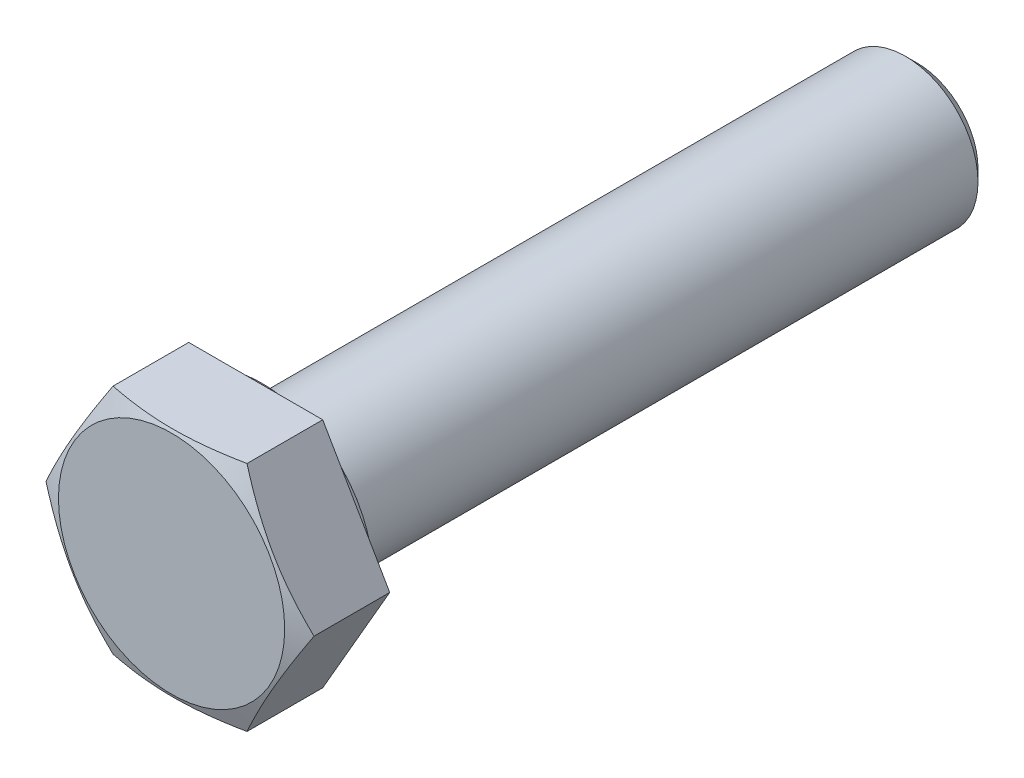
ISO-10303-21;
HEADER;
FILE_DESCRIPTION(('STEP AP214'),'2;1');
FILE_NAME('part.step','',(''),(''),'','','');
FILE_SCHEMA(('AUTOMOTIVE_DESIGN { 1 0 10303 214 1 1 1 1 }'));
ENDSEC;
DATA;
#1=APPLICATION_CONTEXT('core data for automotive mechanical design processes');
#2=APPLICATION_PROTOCOL_DEFINITION('international standard','automotive_design',2000,#1);
#3=PRODUCT_CONTEXT('',#1,'mechanical');
#4=PRODUCT('Part','Part','',(#3));
#5=PRODUCT_RELATED_PRODUCT_CATEGORY('part','',(#4));
#6=PRODUCT_DEFINITION_FORMATION('','',#4);
#7=PRODUCT_DEFINITION_CONTEXT('part definition',#1,'design');
#8=PRODUCT_DEFINITION('design','',#6,#7);
#9=PRODUCT_DEFINITION_SHAPE('','',#8);
#10=(LENGTH_UNIT() NAMED_UNIT(*) SI_UNIT(.MILLI.,.METRE.));
#11=(NAMED_UNIT(*) PLANE_ANGLE_UNIT() SI_UNIT($,.RADIAN.));
#12=(NAMED_UNIT(*) SI_UNIT($,.STERADIAN.) SOLID_ANGLE_UNIT());
#13=UNCERTAINTY_MEASURE_WITH_UNIT(LENGTH_MEASURE(1.E-05),#10,'distance_accuracy_value','');
#14=(GEOMETRIC_REPRESENTATION_CONTEXT(3) GLOBAL_UNCERTAINTY_ASSIGNED_CONTEXT((#13)) GLOBAL_UNIT_ASSIGNED_CONTEXT((#10,
#11,#12)) REPRESENTATION_CONTEXT('',''));
#15=CARTESIAN_POINT('',(0.,0.,0.));
#16=DIRECTION('',(0.,0.,1.));
#17=DIRECTION('',(1.,0.,0.));
#18=AXIS2_PLACEMENT_3D('',#15,#16,#17);
#19=CARTESIAN_POINT('',(0.,7.835,0.6));
#20=DIRECTION('',(0.,0.,1.));
#21=DIRECTION('',(1.,0.,0.));
#22=AXIS2_PLACEMENT_3D('',#19,#20,#21);
#23=PLANE('',#22);
#24=CARTESIAN_POINT('',(0.,0.,0.6));
#25=DIRECTION('',(0.,0.,1.));
#26=DIRECTION('',(1.,0.,0.));
#27=AXIS2_PLACEMENT_3D('',#24,#25,#26);
#28=CIRCLE('',#27,7.835);
#29=CARTESIAN_POINT('',(7.835,0.,0.6));
#30=VERTEX_POINT('',#29);
#31=EDGE_CURVE('E228',#30,#30,#28,.T.);
#32=ORIENTED_EDGE('',*,*,#31,.T.);
#33=EDGE_LOOP('',(#32));
#34=FACE_BOUND('',#33,.T.);
#35=DIRECTION('',(-1.,0.,0.));
#36=VECTOR('',#35,1.);
#37=CARTESIAN_POINT('',(0.,-7.99999626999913,0.6));
#38=LINE('',#37,#36);
#39=CARTESIAN_POINT('',(4.6188,-7.99999626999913,0.6));
#40=VERTEX_POINT('',#39);
#41=CARTESIAN_POINT('',(-4.6188,-7.99999626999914,0.6));
#42=VERTEX_POINT('',#41);
#43=EDGE_CURVE('E214',#40,#42,#38,.T.);
#44=ORIENTED_EDGE('',*,*,#43,.T.);
#45=DIRECTION('',(-0.5,0.866025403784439,0.));
#46=VECTOR('',#45,1.);
#47=CARTESIAN_POINT('',(-10.3208545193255,1.87625186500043,0.6));
#48=LINE('',#47,#46);
#49=CARTESIAN_POINT('',(-9.2376,0.,0.6));
#50=VERTEX_POINT('',#49);
#51=EDGE_CURVE('E83',#42,#50,#48,.T.);
#52=ORIENTED_EDGE('',*,*,#51,.T.);
#53=DIRECTION('',(0.5,0.866025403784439,0.));
#54=VECTOR('',#53,1.);
#55=CARTESIAN_POINT('',(-3.53554548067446,9.87624813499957,0.6));
#56=LINE('',#55,#54);
#57=CARTESIAN_POINT('',(-4.6188,7.99999626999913,0.6));
#58=VERTEX_POINT('',#57);
#59=EDGE_CURVE('E222',#50,#58,#56,.T.);
#60=ORIENTED_EDGE('',*,*,#59,.T.);
#61=DIRECTION('',(1.,0.,0.));
#62=VECTOR('',#61,1.);
#63=CARTESIAN_POINT('',(0.,7.99999626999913,0.6));
#64=LINE('',#63,#62);
#65=CARTESIAN_POINT('',(4.6188,7.99999626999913,0.6));
#66=VERTEX_POINT('',#65);
#67=EDGE_CURVE('E219',#58,#66,#64,.T.);
#68=ORIENTED_EDGE('',*,*,#67,.T.);
#69=DIRECTION('',(0.5,-0.866025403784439,0.));
#70=VECTOR('',#69,1.);
#71=CARTESIAN_POINT('',(3.53554548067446,9.87624813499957,0.6));
#72=LINE('',#71,#70);
#73=CARTESIAN_POINT('',(9.2376,0.,0.6));
#74=VERTEX_POINT('',#73);
#75=EDGE_CURVE('E217',#66,#74,#72,.T.);
#76=ORIENTED_EDGE('',*,*,#75,.T.);
#77=DIRECTION('',(-0.5,-0.866025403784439,0.));
#78=VECTOR('',#77,1.);
#79=CARTESIAN_POINT('',(10.3208545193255,1.87625186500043,0.6));
#80=LINE('',#79,#78);
#81=EDGE_CURVE('E202',#74,#40,#80,.T.);
#82=ORIENTED_EDGE('',*,*,#81,.T.);
#83=EDGE_LOOP('',(#44,#52,#60,#68,#76,#82));
#84=FACE_BOUND('',#83,.T.);
#85=ADVANCED_FACE('F16',(#34,#84),#23,.F.);
#86=CARTESIAN_POINT('',(0.,0.,-45.));
#87=DIRECTION('',(0.,0.,1.));
#88=DIRECTION('',(1.,0.,0.));
#89=AXIS2_PLACEMENT_3D('',#86,#87,#88);
#90=PLANE('',#89);
#91=CARTESIAN_POINT('',(0.,0.,-45.));
#92=DIRECTION('',(0.,0.,1.));
#93=DIRECTION('',(1.,0.,0.));
#94=AXIS2_PLACEMENT_3D('',#91,#92,#93);
#95=CIRCLE('',#94,4.188125);
#96=CARTESIAN_POINT('',(4.188125,0.,-45.));
#97=VERTEX_POINT('',#96);
#98=EDGE_CURVE('E76',#97,#97,#95,.T.);
#99=ORIENTED_EDGE('',*,*,#98,.F.);
#100=EDGE_LOOP('',(#99));
#101=FACE_BOUND('',#100,.T.);
#102=ADVANCED_FACE('F18',(#101),#90,.F.);
#103=CARTESIAN_POINT('',(0.,0.,-45.));
#104=DIRECTION('',(0.,0.,1.));
#105=DIRECTION('',(1.,0.,0.));
#106=AXIS2_PLACEMENT_3D('',#103,#104,#105);
#107=CONICAL_SURFACE('',#106,4.188125,0.785398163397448);
#108=CARTESIAN_POINT('',(0.,0.,-44.188125));
#109=DIRECTION('',(0.,0.,1.));
#110=DIRECTION('',(1.,0.,0.));
#111=AXIS2_PLACEMENT_3D('',#108,#109,#110);
#112=CIRCLE('',#111,5.);
#113=CARTESIAN_POINT('',(5.,0.,-44.188125));
#114=VERTEX_POINT('',#113);
#115=EDGE_CURVE('E172',#114,#114,#112,.T.);
#116=ORIENTED_EDGE('',*,*,#115,.F.);
#117=EDGE_LOOP('',(#116));
#118=FACE_BOUND('',#117,.T.);
#119=ORIENTED_EDGE('',*,*,#98,.T.);
#120=EDGE_LOOP('',(#119));
#121=FACE_BOUND('',#120,.T.);
#122=ADVANCED_FACE('F134',(#118,#121),#107,.T.);
#123=CARTESIAN_POINT('',(0.,0.,6.4));
#124=DIRECTION('',(0.,0.,1.));
#125=DIRECTION('',(1.,0.,0.));
#126=AXIS2_PLACEMENT_3D('',#123,#124,#125);
#127=CYLINDRICAL_SURFACE('',#126,5.);
#128=CARTESIAN_POINT('',(0.,0.,-1.5));
#129=DIRECTION('',(0.,0.,1.));
#130=DIRECTION('',(1.,0.,0.));
#131=AXIS2_PLACEMENT_3D('',#128,#129,#130);
#132=CIRCLE('',#131,5.);
#133=CARTESIAN_POINT('',(5.,0.,-1.5));
#134=VERTEX_POINT('',#133);
#135=EDGE_CURVE('E176',#134,#134,#132,.T.);
#136=ORIENTED_EDGE('',*,*,#135,.F.);
#137=EDGE_LOOP('',(#136));
#138=FACE_BOUND('',#137,.T.);
#139=ORIENTED_EDGE('',*,*,#115,.T.);
#140=EDGE_LOOP('',(#139));
#141=FACE_BOUND('',#140,.T.);
#142=ADVANCED_FACE('F161',(#138,#141),#127,.T.);
#143=CARTESIAN_POINT('',(0.,5.,-1.5));
#144=DIRECTION('',(0.,0.,-1.));
#145=DIRECTION('',(-1.,0.,0.));
#146=AXIS2_PLACEMENT_3D('',#143,#144,#145);
#147=PLANE('',#146);
#148=CARTESIAN_POINT('',(0.,0.,-1.5));
#149=DIRECTION('',(0.,0.,1.));
#150=DIRECTION('',(1.,0.,0.));
#151=AXIS2_PLACEMENT_3D('',#148,#149,#150);
#152=CIRCLE('',#151,4.188125);
#153=CARTESIAN_POINT('',(4.188125,0.,-1.5));
#154=VERTEX_POINT('',#153);
#155=EDGE_CURVE('E242',#154,#154,#152,.T.);
#156=ORIENTED_EDGE('',*,*,#155,.F.);
#157=EDGE_LOOP('',(#156));
#158=FACE_BOUND('',#157,.T.);
#159=ORIENTED_EDGE('',*,*,#135,.T.);
#160=EDGE_LOOP('',(#159));
#161=FACE_BOUND('',#160,.T.);
#162=ADVANCED_FACE('F157',(#158,#161),#147,.F.);
#163=CARTESIAN_POINT('',(0.,0.,-1.5));
#164=DIRECTION('',(0.,0.,1.));
#165=DIRECTION('',(1.,0.,0.));
#166=AXIS2_PLACEMENT_3D('',#163,#164,#165);
#167=CONICAL_SURFACE('',#166,4.188125,1.0471975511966);
#168=CARTESIAN_POINT('',(0.,0.,-1.03126375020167));
#169=DIRECTION('',(0.,0.,1.));
#170=DIRECTION('',(1.,0.,0.));
#171=AXIS2_PLACEMENT_3D('',#168,#169,#170);
#172=CIRCLE('',#171,5.);
#173=CARTESIAN_POINT('',(5.,0.,-1.03126375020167));
#174=VERTEX_POINT('',#173);
#175=EDGE_CURVE('E239',#174,#174,#172,.T.);
#176=ORIENTED_EDGE('',*,*,#175,.F.);
#177=EDGE_LOOP('',(#176));
#178=FACE_BOUND('',#177,.T.);
#179=ORIENTED_EDGE('',*,*,#155,.T.);
#180=EDGE_LOOP('',(#179));
#181=FACE_BOUND('',#180,.T.);
#182=ADVANCED_FACE('F153',(#178,#181),#167,.T.);
#183=CARTESIAN_POINT('',(0.,0.,6.4));
#184=DIRECTION('',(0.,0.,1.));
#185=DIRECTION('',(1.,0.,0.));
#186=AXIS2_PLACEMENT_3D('',#183,#184,#185);
#187=CYLINDRICAL_SURFACE('',#186,5.);
#188=CARTESIAN_POINT('',(0.,0.,-0.5));
#189=DIRECTION('',(0.,0.,1.));
#190=DIRECTION('',(1.,0.,0.));
#191=AXIS2_PLACEMENT_3D('',#188,#189,#190);
#192=CIRCLE('',#191,5.);
#193=CARTESIAN_POINT('',(5.,0.,-0.5));
#194=VERTEX_POINT('',#193);
#195=EDGE_CURVE('E236',#194,#194,#192,.T.);
#196=ORIENTED_EDGE('',*,*,#195,.F.);
#197=EDGE_LOOP('',(#196));
#198=FACE_BOUND('',#197,.T.);
#199=ORIENTED_EDGE('',*,*,#175,.T.);
#200=EDGE_LOOP('',(#199));
#201=FACE_BOUND('',#200,.T.);
#202=ADVANCED_FACE('F149',(#198,#201),#187,.T.);
#203=CARTESIAN_POINT('',(0.,0.,-0.5));
#204=DIRECTION('',(0.,0.,1.));
#205=DIRECTION('',(1.,0.,0.));
#206=AXIS2_PLACEMENT_3D('',#203,#204,#205);
#207=TOROIDAL_SURFACE('',#206,5.5,0.5);
#208=ORIENTED_EDGE('',*,*,#195,.T.);
#209=EDGE_LOOP('',(#208));
#210=FACE_BOUND('',#209,.T.);
#211=CARTESIAN_POINT('',(0.,0.,0.));
#212=DIRECTION('',(0.,0.,1.));
#213=DIRECTION('',(1.,0.,0.));
#214=AXIS2_PLACEMENT_3D('',#211,#212,#213);
#215=CIRCLE('',#214,5.5);
#216=CARTESIAN_POINT('',(5.5,0.,0.));
#217=VERTEX_POINT('',#216);
#218=EDGE_CURVE('E233',#217,#217,#215,.T.);
#219=ORIENTED_EDGE('',*,*,#218,.F.);
#220=EDGE_LOOP('',(#219));
#221=FACE_BOUND('',#220,.T.);
#222=ADVANCED_FACE('F145',(#210,#221),#207,.F.);
#223=CARTESIAN_POINT('',(0.,5.5,0.));
#224=DIRECTION('',(0.,0.,1.));
#225=DIRECTION('',(1.,0.,0.));
#226=AXIS2_PLACEMENT_3D('',#223,#224,#225);
#227=PLANE('',#226);
#228=CARTESIAN_POINT('',(0.,0.,0.));
#229=DIRECTION('',(0.,0.,1.));
#230=DIRECTION('',(1.,0.,0.));
#231=AXIS2_PLACEMENT_3D('',#228,#229,#230);
#232=CIRCLE('',#231,7.235);
#233=CARTESIAN_POINT('',(7.235,0.,0.));
#234=VERTEX_POINT('',#233);
#235=EDGE_CURVE('E230',#234,#234,#232,.T.);
#236=ORIENTED_EDGE('',*,*,#235,.F.);
#237=EDGE_LOOP('',(#236));
#238=FACE_BOUND('',#237,.T.);
#239=ORIENTED_EDGE('',*,*,#218,.T.);
#240=EDGE_LOOP('',(#239));
#241=FACE_BOUND('',#240,.T.);
#242=ADVANCED_FACE('F141',(#238,#241),#227,.F.);
#243=CARTESIAN_POINT('',(0.,0.,0.6));
#244=DIRECTION('',(0.,0.,1.));
#245=DIRECTION('',(1.,0.,0.));
#246=AXIS2_PLACEMENT_3D('',#243,#244,#245);
#247=TOROIDAL_SURFACE('',#246,7.235,0.6);
#248=ORIENTED_EDGE('',*,*,#31,.F.);
#249=EDGE_LOOP('',(#248));
#250=FACE_BOUND('',#249,.T.);
#251=ORIENTED_EDGE('',*,*,#235,.T.);
#252=EDGE_LOOP('',(#251));
#253=FACE_BOUND('',#252,.T.);
#254=ADVANCED_FACE('F116',(#250,#253),#247,.T.);
#255=CARTESIAN_POINT('',(-4.6188,-7.99999626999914,-45.));
#256=DIRECTION('',(0.866025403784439,0.5,0.));
#257=DIRECTION('',(0.5,-0.866025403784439,0.));
#258=AXIS2_PLACEMENT_3D('',#255,#256,#257);
#259=PLANE('',#258);
#260=ORIENTED_EDGE('',*,*,#51,.F.);
#261=DIRECTION('',(0.,0.,1.));
#262=VECTOR('',#261,1.);
#263=CARTESIAN_POINT('',(-4.6188,-7.99999626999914,-45.));
#264=LINE('',#263,#262);
#265=CARTESIAN_POINT('',(-4.6188,-7.99999626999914,5.81818181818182));
#266=VERTEX_POINT('',#265);
#267=EDGE_CURVE('E36',#42,#266,#264,.T.);
#268=ORIENTED_EDGE('',*,*,#267,.T.);
#269=CARTESIAN_POINT('',(-9.23760011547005,2.E-07,5.81818177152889));
#270=CARTESIAN_POINT('',(-9.07623171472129,-0.27949806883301,5.88338258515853));
#271=CARTESIAN_POINT('',(-8.91433070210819,-0.559918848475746,5.94367122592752));
#272=CARTESIAN_POINT('',(-8.58945812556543,-1.12261465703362,6.05257118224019));
#273=CARTESIAN_POINT('',(-8.42648599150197,-1.40489067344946,6.10117565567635));
#274=CARTESIAN_POINT('',(-8.09970314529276,-1.97089516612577,6.184761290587));
#275=CARTESIAN_POINT('',(-7.93589269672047,-2.25462318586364,6.21974649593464));
#276=CARTESIAN_POINT('',(-7.60766331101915,-2.82313315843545,6.27447232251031));
#277=CARTESIAN_POINT('',(-7.44324451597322,-3.10791486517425,6.2942163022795));
#278=CARTESIAN_POINT('',(-7.11690996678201,-3.67314288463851,6.31723187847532));
#279=CARTESIAN_POINT('',(-6.95499911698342,-3.95358070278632,6.3207774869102));
#280=CARTESIAN_POINT('',(-6.631273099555,-4.51429061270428,6.31195075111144));
#281=CARTESIAN_POINT('',(-6.46945794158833,-4.79456268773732,6.29957700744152));
#282=CARTESIAN_POINT('',(-6.14641204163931,-5.35409459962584,6.25957675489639));
#283=CARTESIAN_POINT('',(-5.98518099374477,-5.63335496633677,6.23195993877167));
#284=CARTESIAN_POINT('',(-5.66348869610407,-6.190542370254,6.16281191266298));
#285=CARTESIAN_POINT('',(-5.50302737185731,-6.46846953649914,6.12128207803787));
#286=CARTESIAN_POINT('',(-5.28250881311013,-6.85041888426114,6.05563542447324));
#287=CARTESIAN_POINT('',(-5.22204978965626,-6.95513698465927,6.03674445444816));
#288=CARTESIAN_POINT('',(-5.1012744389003,-7.16432602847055,5.99731748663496));
#289=CARTESIAN_POINT('',(-5.04095809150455,-7.26879700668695,5.9767817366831));
#290=CARTESIAN_POINT('',(-4.920256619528,-7.4778580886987,5.93408711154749));
#291=CARTESIAN_POINT('',(-4.85987196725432,-7.58244737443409,5.91192291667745));
#292=CARTESIAN_POINT('',(-4.73923496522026,-7.79139679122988,5.86612783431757));
#293=CARTESIAN_POINT('',(-4.67898263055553,-7.89575689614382,5.84249678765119));
#294=CARTESIAN_POINT('',(-4.61879988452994,-7.99999646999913,5.81818177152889));
#295=B_SPLINE_CURVE_WITH_KNOTS('',3,(#269,#270,#271,#272,#273,#274,#275,#276,#277,#278,#279,
#280,#281,#282,#283,#284,#285,#286,#287,#288,#289,#290,#291,#292,#293,#294),.UNSPECIFIED.,.F.,
.F.,(4,2,2,2,2,2,2,2,2,2,2,2,4),(0.,0.98784021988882,1.97625750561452,2.96438108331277,
3.95228685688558,4.92341776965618,5.89463405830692,6.86523348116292,7.83573698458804,
8.20288448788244,8.56997677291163,8.93832669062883,9.3067166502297),.UNSPECIFIED.);
#296=CARTESIAN_POINT('',(-9.2376,0.,5.81818181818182));
#297=VERTEX_POINT('',#296);
#298=EDGE_CURVE('E11',#297,#266,#295,.T.);
#299=ORIENTED_EDGE('',*,*,#298,.F.);
#300=DIRECTION('',(0.,0.,1.));
#301=VECTOR('',#300,1.);
#302=CARTESIAN_POINT('',(-9.2376,0.,-45.));
#303=LINE('',#302,#301);
#304=EDGE_CURVE('E212',#50,#297,#303,.T.);
#305=ORIENTED_EDGE('',*,*,#304,.F.);
#306=EDGE_LOOP('',(#260,#268,#299,#305));
#307=FACE_BOUND('',#306,.T.);
#308=ADVANCED_FACE('F79',(#307),#259,.F.);
#309=CARTESIAN_POINT('',(-9.2376,0.,-45.));
#310=DIRECTION('',(0.866025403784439,-0.5,0.));
#311=DIRECTION('',(-0.5,-0.866025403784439,0.));
#312=AXIS2_PLACEMENT_3D('',#309,#310,#311);
#313=PLANE('',#312);
#314=ORIENTED_EDGE('',*,*,#59,.F.);
#315=ORIENTED_EDGE('',*,*,#304,.T.);
#316=CARTESIAN_POINT('',(-4.61879988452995,7.99999646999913,5.81818177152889));
#317=CARTESIAN_POINT('',(-4.78016828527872,7.72049820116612,5.88338258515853));
#318=CARTESIAN_POINT('',(-4.94206929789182,7.44007742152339,5.94367122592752));
#319=CARTESIAN_POINT('',(-5.26694187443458,6.87738161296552,6.0525711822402));
#320=CARTESIAN_POINT('',(-5.42991400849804,6.59510559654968,6.10117565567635));
#321=CARTESIAN_POINT('',(-5.75669685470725,6.02910110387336,6.184761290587));
#322=CARTESIAN_POINT('',(-5.92050730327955,5.7453730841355,6.21974649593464));
#323=CARTESIAN_POINT('',(-6.24873668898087,5.17686311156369,6.27447232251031));
#324=CARTESIAN_POINT('',(-6.4131554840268,4.89208140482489,6.2942163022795));
#325=CARTESIAN_POINT('',(-6.73949003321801,4.32685338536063,6.31723187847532));
#326=CARTESIAN_POINT('',(-6.90140088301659,4.04641556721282,6.3207774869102));
#327=CARTESIAN_POINT('',(-7.22512690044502,3.48570565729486,6.31195075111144));
#328=CARTESIAN_POINT('',(-7.38694205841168,3.20543358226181,6.29957700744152));
#329=CARTESIAN_POINT('',(-7.7099879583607,2.6459016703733,6.25957675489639));
#330=CARTESIAN_POINT('',(-7.87121900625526,2.36664130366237,6.23195993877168));
#331=CARTESIAN_POINT('',(-8.19291130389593,1.80945389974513,6.16281191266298));
#332=CARTESIAN_POINT('',(-8.35337262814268,1.53152673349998,6.12128207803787));
#333=CARTESIAN_POINT('',(-8.57389118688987,1.14957738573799,6.05563542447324));
#334=CARTESIAN_POINT('',(-8.63435021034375,1.04485928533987,6.03674445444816));
#335=CARTESIAN_POINT('',(-8.75512556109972,0.835670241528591,5.99731748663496));
#336=CARTESIAN_POINT('',(-8.81544190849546,0.731199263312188,5.97678173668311));
#337=CARTESIAN_POINT('',(-8.93614338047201,0.522138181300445,5.93408711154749));
#338=CARTESIAN_POINT('',(-8.9965280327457,0.417548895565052,5.91192291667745));
#339=CARTESIAN_POINT('',(-9.11716503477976,0.208599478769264,5.86612783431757));
#340=CARTESIAN_POINT('',(-9.17741736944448,0.104239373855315,5.84249678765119));
#341=CARTESIAN_POINT('',(-9.23760011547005,-1.99999999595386E-07,5.81818177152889));
#342=B_SPLINE_CURVE_WITH_KNOTS('',3,(#316,#317,#318,#319,#320,#321,#322,#323,#324,#325,#326,
#327,#328,#329,#330,#331,#332,#333,#334,#335,#336,#337,#338,#339,#340,#341),.UNSPECIFIED.,.F.,
.F.,(4,2,2,2,2,2,2,2,2,2,2,2,4),(0.,0.987840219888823,1.97625750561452,2.96438108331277,
3.95228685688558,4.92341776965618,5.89463405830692,6.86523348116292,7.83573698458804,
8.20288448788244,8.56997677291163,8.93832669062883,9.3067166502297),.UNSPECIFIED.);
#343=CARTESIAN_POINT('',(-4.6188,7.99999626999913,5.81818181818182));
#344=VERTEX_POINT('',#343);
#345=EDGE_CURVE('E29',#344,#297,#342,.T.);
#346=ORIENTED_EDGE('',*,*,#345,.F.);
#347=DIRECTION('',(0.,0.,1.));
#348=VECTOR('',#347,1.);
#349=CARTESIAN_POINT('',(-4.6188,7.99999626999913,-45.));
#350=LINE('',#349,#348);
#351=EDGE_CURVE('E207',#58,#344,#350,.T.);
#352=ORIENTED_EDGE('',*,*,#351,.F.);
#353=EDGE_LOOP('',(#314,#315,#346,#352));
#354=FACE_BOUND('',#353,.T.);
#355=ADVANCED_FACE('F108',(#354),#313,.F.);
#356=CARTESIAN_POINT('',(-4.6188,7.99999626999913,-45.));
#357=DIRECTION('',(0.,-1.,0.));
#358=DIRECTION('',(-1.,0.,0.));
#359=AXIS2_PLACEMENT_3D('',#356,#357,#358);
#360=PLANE('',#359);
#361=ORIENTED_EDGE('',*,*,#67,.F.);
#362=ORIENTED_EDGE('',*,*,#351,.T.);
#363=CARTESIAN_POINT('',(-12.5719547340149,7.99999626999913,3.52982738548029));
#364=CARTESIAN_POINT('',(-12.1983187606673,7.99999626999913,3.65714990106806));
#365=CARTESIAN_POINT('',(-11.8241969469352,7.99999626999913,3.78307295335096));
#366=CARTESIAN_POINT('',(-11.0747197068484,7.99999626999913,4.03131289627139));
#367=CARTESIAN_POINT('',(-10.6993641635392,7.99999626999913,4.15362943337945));
#368=CARTESIAN_POINT('',(-9.94620503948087,7.99999626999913,4.39415137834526));
#369=CARTESIAN_POINT('',(-9.56839757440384,7.99999626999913,4.51234466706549));
#370=CARTESIAN_POINT('',(-8.81107863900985,7.99999626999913,4.74312776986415));
#371=CARTESIAN_POINT('',(-8.43156721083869,7.99999626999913,4.85571772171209));
#372=CARTESIAN_POINT('',(-7.67246142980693,7.99999626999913,5.07327543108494));
#373=CARTESIAN_POINT('',(-7.29287748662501,7.99999626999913,5.1782793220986));
#374=CARTESIAN_POINT('',(-6.53133965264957,7.99999626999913,5.37943691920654));
#375=CARTESIAN_POINT('',(-6.14938567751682,7.99999626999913,5.47559030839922));
#376=CARTESIAN_POINT('',(-5.38308686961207,7.99999626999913,5.65661961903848));
#377=CARTESIAN_POINT('',(-4.99874399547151,7.99999626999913,5.74150375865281));
#378=CARTESIAN_POINT('',(-4.22720948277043,7.99999626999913,5.89721151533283));
#379=CARTESIAN_POINT('',(-3.84001810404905,7.99999626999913,5.96803639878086));
#380=CARTESIAN_POINT('',(-3.15468340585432,7.99999626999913,6.07772100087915));
#381=CARTESIAN_POINT('',(-2.85711851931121,7.99999626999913,6.12017938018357));
#382=CARTESIAN_POINT('',(-2.26056309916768,7.99999626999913,6.19360511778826));
#383=CARTESIAN_POINT('',(-1.96157260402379,7.99999626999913,6.22457278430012));
#384=CARTESIAN_POINT('',(-1.36269467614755,7.99999626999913,6.27378877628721));
#385=CARTESIAN_POINT('',(-1.06280781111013,7.99999626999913,6.29204392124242));
#386=CARTESIAN_POINT('',(-0.462511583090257,7.99999626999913,6.31505964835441));
#387=CARTESIAN_POINT('',(-0.162102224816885,7.99999626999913,6.31982035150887));
#388=CARTESIAN_POINT('',(0.438718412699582,7.99999626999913,6.31562600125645));
#389=CARTESIAN_POINT('',(0.73912965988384,7.99999626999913,6.30666642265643));
#390=CARTESIAN_POINT('',(1.33925291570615,7.99999626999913,6.27543464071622));
#391=CARTESIAN_POINT('',(1.63896491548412,7.99999626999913,6.25316226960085));
#392=CARTESIAN_POINT('',(2.23737206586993,7.99999626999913,6.19623962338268));
#393=CARTESIAN_POINT('',(2.53606652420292,7.99999626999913,6.16158216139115));
#394=CARTESIAN_POINT('',(3.13194924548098,7.99999626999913,6.08119272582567));
#395=CARTESIAN_POINT('',(3.42913747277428,7.99999626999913,6.03546049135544));
#396=CARTESIAN_POINT('',(4.11363187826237,7.99999626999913,5.91871471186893));
#397=CARTESIAN_POINT('',(4.50034816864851,7.99999626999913,5.84425774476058));
#398=CARTESIAN_POINT('',(5.27095740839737,7.99999626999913,5.68198807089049));
#399=CARTESIAN_POINT('',(5.65485012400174,7.99999626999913,5.59417427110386));
#400=CARTESIAN_POINT('',(6.420254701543,7.99999626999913,5.40788960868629));
#401=CARTESIAN_POINT('',(6.80176506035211,7.99999626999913,5.30941262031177));
#402=CARTESIAN_POINT('',(7.5624958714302,7.99999626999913,5.10408437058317));
#403=CARTESIAN_POINT('',(7.94171640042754,7.99999626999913,4.99723339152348));
#404=CARTESIAN_POINT('',(8.6992633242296,7.99999626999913,4.77660865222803));
#405=CARTESIAN_POINT('',(9.07758437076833,7.99999626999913,4.66281661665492));
#406=CARTESIAN_POINT('',(9.83259783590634,7.99999626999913,4.42994140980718));
#407=CARTESIAN_POINT('',(10.2092902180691,7.99999626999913,4.31085812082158));
#408=CARTESIAN_POINT('',(10.9604179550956,7.99999626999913,4.06875367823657));
#409=CARTESIAN_POINT('',(11.3348565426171,7.99999626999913,3.94574252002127));
#410=CARTESIAN_POINT('',(12.0825558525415,7.99999626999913,3.69629462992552));
#411=CARTESIAN_POINT('',(12.4558166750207,7.99999626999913,3.56985819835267));
#412=CARTESIAN_POINT('',(12.8286123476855,7.99999626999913,3.44208796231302));
#413=B_SPLINE_CURVE_WITH_KNOTS('',3,(#363,#364,#365,#366,#367,#368,#369,#370,#371,#372,#373,
#374,#375,#376,#377,#378,#379,#380,#381,#382,#383,#384,#385,#386,#387,#388,#389,#390,#391,#392,
#393,#394,#395,#396,#397,#398,#399,#400,#401,#402,#403,#404,#405,#406,#407,#408,#409,#410,#411,
#412),.UNSPECIFIED.,.F.,.F.,(4,2,2,2,2,2,2,2,2,2,2,2,2,2,2,2,2,2,2,2,2,2,2,2,4),(0.,
1.18421166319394,2.36853902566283,3.55609567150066,4.74362310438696,5.92505950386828,
7.10653818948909,8.28715048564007,9.46765639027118,10.3692009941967,11.2707214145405,
12.1717578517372,13.0727862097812,13.9741118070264,14.8754487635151,15.777309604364,
16.6791916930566,17.8603375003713,19.0415800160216,20.2235047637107,21.4053896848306,
22.5905333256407,23.7757033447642,24.9580661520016,26.1403256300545),.UNSPECIFIED.);
#414=CARTESIAN_POINT('',(4.6188,7.99999626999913,5.81818181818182));
#415=VERTEX_POINT('',#414);
#416=EDGE_CURVE('E90',#415,#344,#413,.F.);
#417=ORIENTED_EDGE('',*,*,#416,.F.);
#418=DIRECTION('',(0.,0.,1.));
#419=VECTOR('',#418,1.);
#420=CARTESIAN_POINT('',(4.6188,7.99999626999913,-45.));
#421=LINE('',#420,#419);
#422=EDGE_CURVE('E204',#66,#415,#421,.T.);
#423=ORIENTED_EDGE('',*,*,#422,.F.);
#424=EDGE_LOOP('',(#361,#362,#417,#423));
#425=FACE_BOUND('',#424,.T.);
#426=ADVANCED_FACE('F111',(#425),#360,.F.);
#427=CARTESIAN_POINT('',(4.6188,7.99999626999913,-45.));
#428=DIRECTION('',(-0.866025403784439,-0.5,0.));
#429=DIRECTION('',(-0.5,0.866025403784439,0.));
#430=AXIS2_PLACEMENT_3D('',#427,#428,#429);
#431=PLANE('',#430);
#432=ORIENTED_EDGE('',*,*,#75,.F.);
#433=ORIENTED_EDGE('',*,*,#422,.T.);
#434=CARTESIAN_POINT('',(9.23760011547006,-2.00000002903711E-07,5.81818177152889));
#435=CARTESIAN_POINT('',(9.07623171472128,0.279498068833,5.88338258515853));
#436=CARTESIAN_POINT('',(8.91433070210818,0.559918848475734,5.94367122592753));
#437=CARTESIAN_POINT('',(8.58945812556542,1.1226146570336,6.0525711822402));
#438=CARTESIAN_POINT('',(8.42648599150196,1.40489067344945,6.10117565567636));
#439=CARTESIAN_POINT('',(8.09970314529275,1.97089516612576,6.18476129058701));
#440=CARTESIAN_POINT('',(7.93589269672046,2.25462318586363,6.21974649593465));
#441=CARTESIAN_POINT('',(7.60766331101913,2.82313315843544,6.27447232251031));
#442=CARTESIAN_POINT('',(7.44324451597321,3.10791486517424,6.29421630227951));
#443=CARTESIAN_POINT('',(7.116909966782,3.6731428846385,6.31723187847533));
#444=CARTESIAN_POINT('',(6.95499911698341,3.95358070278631,6.3207774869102));
#445=CARTESIAN_POINT('',(6.63127309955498,4.51429061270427,6.31195075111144));
#446=CARTESIAN_POINT('',(6.46945794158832,4.79456268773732,6.29957700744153));
#447=CARTESIAN_POINT('',(6.1464120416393,5.35409459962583,6.25957675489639));
#448=CARTESIAN_POINT('',(5.98518099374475,5.63335496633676,6.23195993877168));
#449=CARTESIAN_POINT('',(5.66348869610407,6.190542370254,6.16281191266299));
#450=CARTESIAN_POINT('',(5.50302737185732,6.46846953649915,6.12128207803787));
#451=CARTESIAN_POINT('',(5.28250881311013,6.85041888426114,6.05563542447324));
#452=CARTESIAN_POINT('',(5.22204978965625,6.95513698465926,6.03674445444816));
#453=CARTESIAN_POINT('',(5.10127443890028,7.16432602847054,5.99731748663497));
#454=CARTESIAN_POINT('',(5.04095809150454,7.26879700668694,5.97678173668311));
#455=CARTESIAN_POINT('',(4.92025661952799,7.47785808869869,5.93408711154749));
#456=CARTESIAN_POINT('',(4.85987196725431,7.58244737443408,5.91192291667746));
#457=CARTESIAN_POINT('',(4.73923496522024,7.79139679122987,5.86612783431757));
#458=CARTESIAN_POINT('',(4.67898263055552,7.89575689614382,5.8424967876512));
#459=CARTESIAN_POINT('',(4.61879988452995,7.99999646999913,5.81818177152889));
#460=B_SPLINE_CURVE_WITH_KNOTS('',3,(#434,#435,#436,#437,#438,#439,#440,#441,#442,#443,#444,
#445,#446,#447,#448,#449,#450,#451,#452,#453,#454,#455,#456,#457,#458,#459),.UNSPECIFIED.,.F.,
.F.,(4,2,2,2,2,2,2,2,2,2,2,2,4),(0.,0.987840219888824,1.97625750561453,2.96438108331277,
3.95228685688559,4.92341776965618,5.89463405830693,6.86523348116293,7.83573698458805,
8.20288448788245,8.56997677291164,8.93832669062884,9.30671665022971),.UNSPECIFIED.);
#461=CARTESIAN_POINT('',(9.2376,0.,5.81818181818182));
#462=VERTEX_POINT('',#461);
#463=EDGE_CURVE('E94',#462,#415,#460,.T.);
#464=ORIENTED_EDGE('',*,*,#463,.F.);
#465=DIRECTION('',(0.,0.,1.));
#466=VECTOR('',#465,1.);
#467=CARTESIAN_POINT('',(9.2376,0.,-45.));
#468=LINE('',#467,#466);
#469=EDGE_CURVE('E201',#74,#462,#468,.T.);
#470=ORIENTED_EDGE('',*,*,#469,.F.);
#471=EDGE_LOOP('',(#432,#433,#464,#470));
#472=FACE_BOUND('',#471,.T.);
#473=ADVANCED_FACE('F190',(#472),#431,.F.);
#474=CARTESIAN_POINT('',(9.2376,0.,-45.));
#475=DIRECTION('',(-0.866025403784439,0.5,0.));
#476=DIRECTION('',(0.5,0.866025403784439,0.));
#477=AXIS2_PLACEMENT_3D('',#474,#475,#476);
#478=PLANE('',#477);
#479=ORIENTED_EDGE('',*,*,#81,.F.);
#480=ORIENTED_EDGE('',*,*,#469,.T.);
#481=CARTESIAN_POINT('',(4.61879988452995,-7.99999646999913,5.81818177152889));
#482=CARTESIAN_POINT('',(4.78016828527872,-7.72049820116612,5.88338258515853));
#483=CARTESIAN_POINT('',(4.94206929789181,-7.44007742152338,5.94367122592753));
#484=CARTESIAN_POINT('',(5.26694187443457,-6.87738161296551,6.0525711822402));
#485=CARTESIAN_POINT('',(5.42991400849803,-6.59510559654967,6.10117565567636));
#486=CARTESIAN_POINT('',(5.75669685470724,-6.02910110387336,6.18476129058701));
#487=CARTESIAN_POINT('',(5.92050730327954,-5.74537308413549,6.21974649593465));
#488=CARTESIAN_POINT('',(6.24873668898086,-5.17686311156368,6.27447232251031));
#489=CARTESIAN_POINT('',(6.41315548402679,-4.89208140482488,6.29421630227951));
#490=CARTESIAN_POINT('',(6.739490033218,-4.32685338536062,6.31723187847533));
#491=CARTESIAN_POINT('',(6.90140088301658,-4.04641556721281,6.3207774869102));
#492=CARTESIAN_POINT('',(7.22512690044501,-3.48570565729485,6.31195075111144));
#493=CARTESIAN_POINT('',(7.38694205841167,-3.2054335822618,6.29957700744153));
#494=CARTESIAN_POINT('',(7.70998795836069,-2.64590167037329,6.25957675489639));
#495=CARTESIAN_POINT('',(7.87121900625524,-2.36664130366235,6.23195993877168));
#496=CARTESIAN_POINT('',(8.19291130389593,-1.80945389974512,6.16281191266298));
#497=CARTESIAN_POINT('',(8.35337262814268,-1.53152673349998,6.12128207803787));
#498=CARTESIAN_POINT('',(8.57389118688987,-1.14957738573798,6.05563542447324));
#499=CARTESIAN_POINT('',(8.63435021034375,-1.04485928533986,6.03674445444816));
#500=CARTESIAN_POINT('',(8.7551255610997,-0.835670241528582,5.99731748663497));
#501=CARTESIAN_POINT('',(8.81544190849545,-0.73119926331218,5.97678173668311));
#502=CARTESIAN_POINT('',(8.93614338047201,-0.522138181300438,5.93408711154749));
#503=CARTESIAN_POINT('',(8.99652803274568,-0.417548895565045,5.91192291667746));
#504=CARTESIAN_POINT('',(9.11716503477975,-0.20859947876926,5.86612783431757));
#505=CARTESIAN_POINT('',(9.17741736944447,-0.104239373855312,5.8424967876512));
#506=CARTESIAN_POINT('',(9.23760011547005,1.99999996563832E-07,5.81818177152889));
#507=B_SPLINE_CURVE_WITH_KNOTS('',3,(#481,#482,#483,#484,#485,#486,#487,#488,#489,#490,#491,
#492,#493,#494,#495,#496,#497,#498,#499,#500,#501,#502,#503,#504,#505,#506),.UNSPECIFIED.,.F.,
.F.,(4,2,2,2,2,2,2,2,2,2,2,2,4),(0.,0.987840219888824,1.97625750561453,2.96438108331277,
3.95228685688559,4.92341776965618,5.89463405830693,6.86523348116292,7.83573698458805,
8.20288448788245,8.56997677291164,8.93832669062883,9.3067166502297),.UNSPECIFIED.);
#508=CARTESIAN_POINT('',(4.6188,-7.99999626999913,5.81818181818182));
#509=VERTEX_POINT('',#508);
#510=EDGE_CURVE('E75',#509,#462,#507,.T.);
#511=ORIENTED_EDGE('',*,*,#510,.F.);
#512=DIRECTION('',(0.,0.,1.));
#513=VECTOR('',#512,1.);
#514=CARTESIAN_POINT('',(4.6188,-7.99999626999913,-45.));
#515=LINE('',#514,#513);
#516=EDGE_CURVE('E41',#40,#509,#515,.T.);
#517=ORIENTED_EDGE('',*,*,#516,.F.);
#518=EDGE_LOOP('',(#479,#480,#511,#517));
#519=FACE_BOUND('',#518,.T.);
#520=ADVANCED_FACE('F126',(#519),#478,.F.);
#521=CARTESIAN_POINT('',(4.6188,-7.99999626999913,-45.));
#522=DIRECTION('',(0.,1.,0.));
#523=DIRECTION('',(1.,0.,0.));
#524=AXIS2_PLACEMENT_3D('',#521,#522,#523);
#525=PLANE('',#524);
#526=ORIENTED_EDGE('',*,*,#43,.F.);
#527=ORIENTED_EDGE('',*,*,#516,.T.);
#528=CARTESIAN_POINT('',(-12.5719547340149,-7.99999626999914,3.52982738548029));
#529=CARTESIAN_POINT('',(-12.1983187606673,-7.99999626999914,3.65714990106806));
#530=CARTESIAN_POINT('',(-11.8241969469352,-7.99999626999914,3.78307295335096));
#531=CARTESIAN_POINT('',(-11.0747197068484,-7.99999626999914,4.03131289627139));
#532=CARTESIAN_POINT('',(-10.6993641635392,-7.99999626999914,4.15362943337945));
#533=CARTESIAN_POINT('',(-9.94620503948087,-7.99999626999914,4.39415137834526));
#534=CARTESIAN_POINT('',(-9.56839757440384,-7.99999626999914,4.51234466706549));
#535=CARTESIAN_POINT('',(-8.81107863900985,-7.99999626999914,4.74312776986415));
#536=CARTESIAN_POINT('',(-8.43156721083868,-7.99999626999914,4.85571772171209));
#537=CARTESIAN_POINT('',(-7.67246142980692,-7.99999626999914,5.07327543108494));
#538=CARTESIAN_POINT('',(-7.29287748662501,-7.99999626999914,5.17827932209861));
#539=CARTESIAN_POINT('',(-6.53133965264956,-7.99999626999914,5.37943691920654));
#540=CARTESIAN_POINT('',(-6.14938567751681,-7.99999626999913,5.47559030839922));
#541=CARTESIAN_POINT('',(-5.38308686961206,-7.99999626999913,5.65661961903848));
#542=CARTESIAN_POINT('',(-4.99874399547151,-7.99999626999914,5.7415037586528));
#543=CARTESIAN_POINT('',(-4.22720948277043,-7.99999626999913,5.89721151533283));
#544=CARTESIAN_POINT('',(-3.84001810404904,-7.99999626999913,5.96803639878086));
#545=CARTESIAN_POINT('',(-3.15468340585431,-7.99999626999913,6.07772100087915));
#546=CARTESIAN_POINT('',(-2.8571185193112,-7.99999626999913,6.12017938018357));
#547=CARTESIAN_POINT('',(-2.26056309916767,-7.99999626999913,6.19360511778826));
#548=CARTESIAN_POINT('',(-1.96157260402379,-7.99999626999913,6.22457278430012));
#549=CARTESIAN_POINT('',(-1.36269467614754,-7.99999626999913,6.27378877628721));
#550=CARTESIAN_POINT('',(-1.06280781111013,-7.99999626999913,6.29204392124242));
#551=CARTESIAN_POINT('',(-0.462511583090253,-7.99999626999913,6.31505964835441));
#552=CARTESIAN_POINT('',(-0.16210222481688,-7.99999626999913,6.31982035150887));
#553=CARTESIAN_POINT('',(0.438718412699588,-7.99999626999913,6.31562600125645));
#554=CARTESIAN_POINT('',(0.739129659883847,-7.99999626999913,6.30666642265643));
#555=CARTESIAN_POINT('',(1.33925291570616,-7.99999626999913,6.27543464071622));
#556=CARTESIAN_POINT('',(1.63896491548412,-7.99999626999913,6.25316226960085));
#557=CARTESIAN_POINT('',(2.23737206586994,-7.99999626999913,6.19623962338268));
#558=CARTESIAN_POINT('',(2.53606652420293,-7.99999626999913,6.16158216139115));
#559=CARTESIAN_POINT('',(3.13194924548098,-7.99999626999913,6.08119272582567));
#560=CARTESIAN_POINT('',(3.42913747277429,-7.99999626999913,6.03546049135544));
#561=CARTESIAN_POINT('',(4.11363187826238,-7.99999626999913,5.91871471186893));
#562=CARTESIAN_POINT('',(4.50034816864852,-7.99999626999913,5.84425774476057));
#563=CARTESIAN_POINT('',(5.27095740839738,-7.99999626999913,5.68198807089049));
#564=CARTESIAN_POINT('',(5.65485012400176,-7.99999626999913,5.59417427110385));
#565=CARTESIAN_POINT('',(6.42025470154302,-7.99999626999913,5.40788960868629));
#566=CARTESIAN_POINT('',(6.80176506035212,-7.99999626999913,5.30941262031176));
#567=CARTESIAN_POINT('',(7.56249587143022,-7.99999626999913,5.10408437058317));
#568=CARTESIAN_POINT('',(7.94171640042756,-7.99999626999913,4.99723339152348));
#569=CARTESIAN_POINT('',(8.69926332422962,-7.99999626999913,4.77660865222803));
#570=CARTESIAN_POINT('',(9.07758437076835,-7.99999626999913,4.66281661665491));
#571=CARTESIAN_POINT('',(9.83259783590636,-7.99999626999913,4.42994140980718));
#572=CARTESIAN_POINT('',(10.2092902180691,-7.99999626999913,4.31085812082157));
#573=CARTESIAN_POINT('',(10.9604179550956,-7.99999626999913,4.06875367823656));
#574=CARTESIAN_POINT('',(11.3348565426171,-7.99999626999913,3.94574252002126));
#575=CARTESIAN_POINT('',(12.0825558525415,-7.99999626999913,3.69629462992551));
#576=CARTESIAN_POINT('',(12.4558166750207,-7.99999626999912,3.56985819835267));
#577=CARTESIAN_POINT('',(12.8286123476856,-7.99999626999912,3.44208796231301));
#578=B_SPLINE_CURVE_WITH_KNOTS('',3,(#528,#529,#530,#531,#532,#533,#534,#535,#536,#537,#538,
#539,#540,#541,#542,#543,#544,#545,#546,#547,#548,#549,#550,#551,#552,#553,#554,#555,#556,#557,
#558,#559,#560,#561,#562,#563,#564,#565,#566,#567,#568,#569,#570,#571,#572,#573,#574,#575,#576,
#577),.UNSPECIFIED.,.F.,.F.,(4,2,2,2,2,2,2,2,2,2,2,2,2,2,2,2,2,2,2,2,2,2,2,2,4),(0.,
1.18421166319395,2.36853902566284,3.55609567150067,4.74362310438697,5.92505950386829,
7.1065381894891,8.28715048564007,9.46765639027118,10.3692009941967,11.2707214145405,
12.1717578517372,13.0727862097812,13.9741118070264,14.8754487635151,15.777309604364,
16.6791916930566,17.8603375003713,19.0415800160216,20.2235047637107,21.4053896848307,
22.5905333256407,23.7757033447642,24.9580661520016,26.1403256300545),.UNSPECIFIED.);
#579=EDGE_CURVE('E71',#266,#509,#578,.T.);
#580=ORIENTED_EDGE('',*,*,#579,.F.);
#581=ORIENTED_EDGE('',*,*,#267,.F.);
#582=EDGE_LOOP('',(#526,#527,#580,#581));
#583=FACE_BOUND('',#582,.T.);
#584=ADVANCED_FACE('F72',(#583),#525,.F.);
#585=CARTESIAN_POINT('',(0.,7.79754946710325,6.4));
#586=DIRECTION('',(0.,0.,-1.));
#587=DIRECTION('',(-1.,0.,0.));
#588=AXIS2_PLACEMENT_3D('',#585,#586,#587);
#589=PLANE('',#588);
#590=CARTESIAN_POINT('',(0.,0.,6.4));
#591=DIRECTION('',(0.,0.,1.));
#592=DIRECTION('',(1.,0.,0.));
#593=AXIS2_PLACEMENT_3D('',#590,#591,#592);
#594=CIRCLE('',#593,7.79754946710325);
#595=CARTESIAN_POINT('',(7.79754946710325,0.,6.4));
#596=VERTEX_POINT('',#595);
#597=EDGE_CURVE('E226',#596,#596,#594,.T.);
#598=ORIENTED_EDGE('',*,*,#597,.T.);
#599=EDGE_LOOP('',(#598));
#600=FACE_BOUND('',#599,.T.);
#601=ADVANCED_FACE('F117',(#600),#589,.F.);
#602=CARTESIAN_POINT('',(0.,0.,5.81818181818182));
#603=DIRECTION('',(0.,0.,-1.));
#604=DIRECTION('',(-1.,0.,0.));
#605=AXIS2_PLACEMENT_3D('',#602,#603,#604);
#606=CONICAL_SURFACE('',#605,9.2376,1.18682389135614);
#607=ORIENTED_EDGE('',*,*,#597,.F.);
#608=EDGE_LOOP('',(#607));
#609=FACE_BOUND('',#608,.T.);
#610=ORIENTED_EDGE('',*,*,#345,.T.);
#611=ORIENTED_EDGE('',*,*,#298,.T.);
#612=ORIENTED_EDGE('',*,*,#579,.T.);
#613=ORIENTED_EDGE('',*,*,#510,.T.);
#614=ORIENTED_EDGE('',*,*,#463,.T.);
#615=ORIENTED_EDGE('',*,*,#416,.T.);
#616=EDGE_LOOP('',(#610,#611,#612,#613,#614,#615));
#617=FACE_BOUND('',#616,.T.);
#618=ADVANCED_FACE('F87',(#609,#617),#606,.T.);
#619=CLOSED_SHELL('',(#85,#102,#122,#142,#162,#182,#202,#222,#242,#254,#308,#355,#426,#473,#520,
#584,#601,#618));
#620=MANIFOLD_SOLID_BREP('B1',#619);
#621=ADVANCED_BREP_SHAPE_REPRESENTATION('',(#18,#620),#14);
#622=SHAPE_DEFINITION_REPRESENTATION(#9,#621);
ENDSEC;
END-ISO-10303-21;
